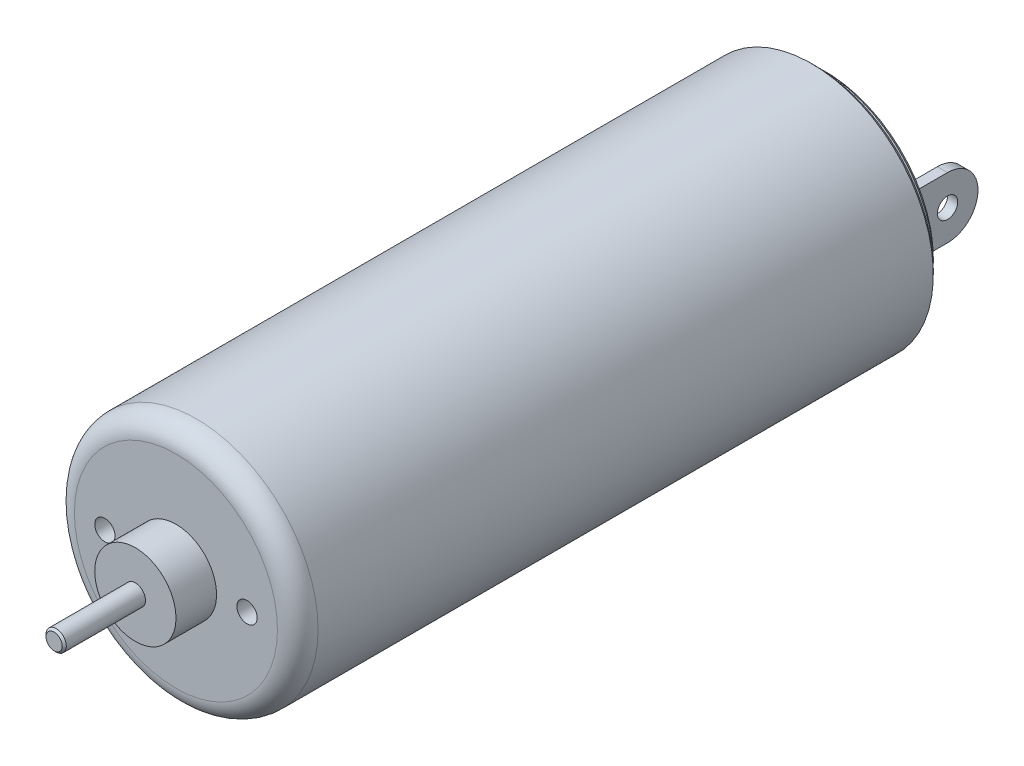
ISO-10303-21;
HEADER;
FILE_DESCRIPTION(('STEP AP214'),'2;1');
FILE_NAME('part.step','',(''),(''),'','','');
FILE_SCHEMA(('AUTOMOTIVE_DESIGN { 1 0 10303 214 1 1 1 1 }'));
ENDSEC;
DATA;
#1=APPLICATION_CONTEXT('core data for automotive mechanical design processes');
#2=APPLICATION_PROTOCOL_DEFINITION('international standard','automotive_design',2000,#1);
#3=PRODUCT_CONTEXT('',#1,'mechanical');
#4=PRODUCT('Part','Part','',(#3));
#5=PRODUCT_RELATED_PRODUCT_CATEGORY('part','',(#4));
#6=PRODUCT_DEFINITION_FORMATION('','',#4);
#7=PRODUCT_DEFINITION_CONTEXT('part definition',#1,'design');
#8=PRODUCT_DEFINITION('design','',#6,#7);
#9=PRODUCT_DEFINITION_SHAPE('','',#8);
#10=(LENGTH_UNIT() NAMED_UNIT(*) SI_UNIT(.MILLI.,.METRE.));
#11=(NAMED_UNIT(*) PLANE_ANGLE_UNIT() SI_UNIT($,.RADIAN.));
#12=(NAMED_UNIT(*) SI_UNIT($,.STERADIAN.) SOLID_ANGLE_UNIT());
#13=UNCERTAINTY_MEASURE_WITH_UNIT(LENGTH_MEASURE(1.E-05),#10,'distance_accuracy_value','');
#14=(GEOMETRIC_REPRESENTATION_CONTEXT(3) GLOBAL_UNCERTAINTY_ASSIGNED_CONTEXT((#13)) GLOBAL_UNIT_ASSIGNED_CONTEXT((#10,
#11,#12)) REPRESENTATION_CONTEXT('',''));
#15=CARTESIAN_POINT('',(0.,0.,0.));
#16=DIRECTION('',(0.,0.,1.));
#17=DIRECTION('',(1.,0.,0.));
#18=AXIS2_PLACEMENT_3D('',#15,#16,#17);
#19=CARTESIAN_POINT('',(-3.5,1.5,-23.));
#20=DIRECTION('',(-1.,0.,0.));
#21=DIRECTION('',(0.,-1.,0.));
#22=AXIS2_PLACEMENT_3D('',#19,#20,#21);
#23=PLANE('',#22);
#24=DIRECTION('',(0.,0.,1.));
#25=VECTOR('',#24,1.);
#26=CARTESIAN_POINT('',(-3.5,1.5,-23.));
#27=LINE('',#26,#25);
#28=CARTESIAN_POINT('',(-3.5,1.5,-21.5));
#29=VERTEX_POINT('',#28);
#30=CARTESIAN_POINT('',(-3.5,1.5,-19.));
#31=VERTEX_POINT('',#30);
#32=EDGE_CURVE('E137',#29,#31,#27,.T.);
#33=ORIENTED_EDGE('',*,*,#32,.F.);
#34=CARTESIAN_POINT('',(-3.5,0.,-21.5));
#35=DIRECTION('',(-1.,0.,0.));
#36=DIRECTION('',(0.,-1.,0.));
#37=AXIS2_PLACEMENT_3D('',#34,#35,#36);
#38=CIRCLE('',#37,1.5);
#39=CARTESIAN_POINT('',(-3.5,0.,-23.));
#40=VERTEX_POINT('',#39);
#41=EDGE_CURVE('E245',#29,#40,#38,.T.);
#42=ORIENTED_EDGE('',*,*,#41,.T.);
#43=CARTESIAN_POINT('',(-3.5,0.,-21.5));
#44=DIRECTION('',(-1.,0.,0.));
#45=DIRECTION('',(0.,-1.,0.));
#46=AXIS2_PLACEMENT_3D('',#43,#44,#45);
#47=CIRCLE('',#46,1.5);
#48=CARTESIAN_POINT('',(-3.5,-1.5,-21.5));
#49=VERTEX_POINT('',#48);
#50=EDGE_CURVE('E112',#40,#49,#47,.T.);
#51=ORIENTED_EDGE('',*,*,#50,.T.);
#52=DIRECTION('',(0.,0.,1.));
#53=VECTOR('',#52,1.);
#54=CARTESIAN_POINT('',(-3.5,-1.5,-23.));
#55=LINE('',#54,#53);
#56=CARTESIAN_POINT('',(-3.5,-1.5,-19.));
#57=VERTEX_POINT('',#56);
#58=EDGE_CURVE('E106',#49,#57,#55,.T.);
#59=ORIENTED_EDGE('',*,*,#58,.T.);
#60=DIRECTION('',(0.,-1.,0.));
#61=VECTOR('',#60,1.);
#62=CARTESIAN_POINT('',(-3.5,1.5,-19.));
#63=LINE('',#62,#61);
#64=EDGE_CURVE('E110',#31,#57,#63,.T.);
#65=ORIENTED_EDGE('',*,*,#64,.F.);
#66=EDGE_LOOP('',(#33,#42,#51,#59,#65));
#67=FACE_BOUND('',#66,.T.);
#68=CARTESIAN_POINT('',(-3.5,0.,-21.5));
#69=DIRECTION('',(1.,0.,0.));
#70=DIRECTION('',(0.,1.,0.));
#71=AXIS2_PLACEMENT_3D('',#68,#69,#70);
#72=CIRCLE('',#71,0.499999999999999);
#73=CARTESIAN_POINT('',(-3.5,0.499999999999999,-21.5));
#74=VERTEX_POINT('',#73);
#75=EDGE_CURVE('E241',#74,#74,#72,.T.);
#76=ORIENTED_EDGE('',*,*,#75,.T.);
#77=EDGE_LOOP('',(#76));
#78=FACE_BOUND('',#77,.T.);
#79=ADVANCED_FACE('F31',(#67,#78),#23,.T.);
#80=CARTESIAN_POINT('',(-3.,1.5,-23.));
#81=DIRECTION('',(1.,0.,0.));
#82=DIRECTION('',(0.,1.,0.));
#83=AXIS2_PLACEMENT_3D('',#80,#81,#82);
#84=PLANE('',#83);
#85=CARTESIAN_POINT('',(-3.,0.,-21.5));
#86=DIRECTION('',(1.,0.,0.));
#87=DIRECTION('',(0.,1.,0.));
#88=AXIS2_PLACEMENT_3D('',#85,#86,#87);
#89=CIRCLE('',#88,1.5);
#90=CARTESIAN_POINT('',(-3.,-1.5,-21.5));
#91=VERTEX_POINT('',#90);
#92=CARTESIAN_POINT('',(-3.,0.,-23.));
#93=VERTEX_POINT('',#92);
#94=EDGE_CURVE('E46',#91,#93,#89,.T.);
#95=ORIENTED_EDGE('',*,*,#94,.T.);
#96=CARTESIAN_POINT('',(-3.,0.,-21.5));
#97=DIRECTION('',(1.,0.,0.));
#98=DIRECTION('',(0.,1.,0.));
#99=AXIS2_PLACEMENT_3D('',#96,#97,#98);
#100=CIRCLE('',#99,1.5);
#101=CARTESIAN_POINT('',(-3.,1.5,-21.5));
#102=VERTEX_POINT('',#101);
#103=EDGE_CURVE('E39',#93,#102,#100,.T.);
#104=ORIENTED_EDGE('',*,*,#103,.T.);
#105=DIRECTION('',(0.,0.,1.));
#106=VECTOR('',#105,1.);
#107=CARTESIAN_POINT('',(-3.,1.5,-23.));
#108=LINE('',#107,#106);
#109=CARTESIAN_POINT('',(-3.,1.5,-19.));
#110=VERTEX_POINT('',#109);
#111=EDGE_CURVE('E135',#102,#110,#108,.T.);
#112=ORIENTED_EDGE('',*,*,#111,.T.);
#113=DIRECTION('',(0.,1.,0.));
#114=VECTOR('',#113,1.);
#115=CARTESIAN_POINT('',(-3.,1.5,-19.));
#116=LINE('',#115,#114);
#117=CARTESIAN_POINT('',(-3.,-1.5,-19.));
#118=VERTEX_POINT('',#117);
#119=EDGE_CURVE('E129',#118,#110,#116,.T.);
#120=ORIENTED_EDGE('',*,*,#119,.F.);
#121=DIRECTION('',(0.,0.,1.));
#122=VECTOR('',#121,1.);
#123=CARTESIAN_POINT('',(-3.,-1.5,-23.));
#124=LINE('',#123,#122);
#125=EDGE_CURVE('E114',#91,#118,#124,.T.);
#126=ORIENTED_EDGE('',*,*,#125,.F.);
#127=EDGE_LOOP('',(#95,#104,#112,#120,#126));
#128=FACE_BOUND('',#127,.T.);
#129=CARTESIAN_POINT('',(-3.,0.,-21.5));
#130=DIRECTION('',(1.,0.,0.));
#131=DIRECTION('',(0.,1.,0.));
#132=AXIS2_PLACEMENT_3D('',#129,#130,#131);
#133=CIRCLE('',#132,0.499999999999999);
#134=CARTESIAN_POINT('',(-3.,0.499999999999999,-21.5));
#135=VERTEX_POINT('',#134);
#136=EDGE_CURVE('E126',#135,#135,#133,.F.);
#137=ORIENTED_EDGE('',*,*,#136,.T.);
#138=EDGE_LOOP('',(#137));
#139=FACE_BOUND('',#138,.T.);
#140=ADVANCED_FACE('F249',(#128,#139),#84,.T.);
#141=CARTESIAN_POINT('',(0.,5.5,-19.));
#142=DIRECTION('',(0.,0.,-1.));
#143=DIRECTION('',(-1.,0.,0.));
#144=AXIS2_PLACEMENT_3D('',#141,#142,#143);
#145=PLANE('',#144);
#146=ORIENTED_EDGE('',*,*,#64,.T.);
#147=DIRECTION('',(1.,0.,0.));
#148=VECTOR('',#147,1.);
#149=CARTESIAN_POINT('',(-3.5,-1.5,-19.));
#150=LINE('',#149,#148);
#151=EDGE_CURVE('E115',#57,#118,#150,.T.);
#152=ORIENTED_EDGE('',*,*,#151,.T.);
#153=ORIENTED_EDGE('',*,*,#119,.T.);
#154=DIRECTION('',(-1.,0.,0.));
#155=VECTOR('',#154,1.);
#156=CARTESIAN_POINT('',(-3.5,1.5,-19.));
#157=LINE('',#156,#155);
#158=EDGE_CURVE('E125',#110,#31,#157,.T.);
#159=ORIENTED_EDGE('',*,*,#158,.T.);
#160=EDGE_LOOP('',(#146,#152,#153,#159));
#161=FACE_BOUND('',#160,.T.);
#162=CARTESIAN_POINT('',(0.,0.,-19.));
#163=DIRECTION('',(0.,0.,-1.));
#164=DIRECTION('',(-1.,0.,0.));
#165=AXIS2_PLACEMENT_3D('',#162,#163,#164);
#166=CIRCLE('',#165,5.3);
#167=CARTESIAN_POINT('',(-5.3,0.,-19.));
#168=VERTEX_POINT('',#167);
#169=EDGE_CURVE('E202',#168,#168,#166,.T.);
#170=ORIENTED_EDGE('',*,*,#169,.T.);
#171=EDGE_LOOP('',(#170));
#172=FACE_BOUND('',#171,.T.);
#173=CARTESIAN_POINT('',(0.,0.,-19.));
#174=DIRECTION('',(0.,0.,-1.));
#175=DIRECTION('',(-1.,0.,0.));
#176=AXIS2_PLACEMENT_3D('',#173,#174,#175);
#177=CIRCLE('',#176,0.7);
#178=CARTESIAN_POINT('',(-0.7,0.,-19.));
#179=VERTEX_POINT('',#178);
#180=EDGE_CURVE('E205',#179,#179,#177,.F.);
#181=ORIENTED_EDGE('',*,*,#180,.T.);
#182=EDGE_LOOP('',(#181));
#183=FACE_BOUND('',#182,.T.);
#184=DIRECTION('',(-1.,0.,0.));
#185=VECTOR('',#184,1.);
#186=CARTESIAN_POINT('',(3.5,-1.5,-19.));
#187=LINE('',#186,#185);
#188=CARTESIAN_POINT('',(3.5,-1.5,-19.));
#189=VERTEX_POINT('',#188);
#190=CARTESIAN_POINT('',(3.,-1.5,-19.));
#191=VERTEX_POINT('',#190);
#192=EDGE_CURVE('E149',#189,#191,#187,.T.);
#193=ORIENTED_EDGE('',*,*,#192,.F.);
#194=DIRECTION('',(0.,-1.,0.));
#195=VECTOR('',#194,1.);
#196=CARTESIAN_POINT('',(3.5,1.5,-19.));
#197=LINE('',#196,#195);
#198=CARTESIAN_POINT('',(3.5,1.5,-19.));
#199=VERTEX_POINT('',#198);
#200=EDGE_CURVE('E146',#199,#189,#197,.T.);
#201=ORIENTED_EDGE('',*,*,#200,.F.);
#202=DIRECTION('',(1.,0.,0.));
#203=VECTOR('',#202,1.);
#204=CARTESIAN_POINT('',(3.5,1.5,-19.));
#205=LINE('',#204,#203);
#206=CARTESIAN_POINT('',(3.,1.5,-19.));
#207=VERTEX_POINT('',#206);
#208=EDGE_CURVE('E155',#207,#199,#205,.T.);
#209=ORIENTED_EDGE('',*,*,#208,.F.);
#210=DIRECTION('',(0.,1.,0.));
#211=VECTOR('',#210,1.);
#212=CARTESIAN_POINT('',(3.,1.5,-19.));
#213=LINE('',#212,#211);
#214=EDGE_CURVE('E152',#191,#207,#213,.T.);
#215=ORIENTED_EDGE('',*,*,#214,.F.);
#216=EDGE_LOOP('',(#193,#201,#209,#215));
#217=FACE_BOUND('',#216,.T.);
#218=ADVANCED_FACE('F120',(#161,#172,#183,#217),#145,.T.);
#219=CARTESIAN_POINT('',(0.,2.,13.));
#220=DIRECTION('',(0.,0.,1.));
#221=DIRECTION('',(1.,0.,0.));
#222=AXIS2_PLACEMENT_3D('',#219,#220,#221);
#223=PLANE('',#222);
#224=CARTESIAN_POINT('',(3.5,0.,13.));
#225=DIRECTION('',(0.,0.,1.));
#226=DIRECTION('',(1.,0.,0.));
#227=AXIS2_PLACEMENT_3D('',#224,#225,#226);
#228=CIRCLE('',#227,0.500000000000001);
#229=CARTESIAN_POINT('',(4.,0.,13.));
#230=VERTEX_POINT('',#229);
#231=EDGE_CURVE('E166',#230,#230,#228,.T.);
#232=ORIENTED_EDGE('',*,*,#231,.F.);
#233=EDGE_LOOP('',(#232));
#234=FACE_BOUND('',#233,.T.);
#235=CARTESIAN_POINT('',(-3.5,0.,13.));
#236=DIRECTION('',(0.,0.,1.));
#237=DIRECTION('',(1.,0.,0.));
#238=AXIS2_PLACEMENT_3D('',#235,#236,#237);
#239=CIRCLE('',#238,0.5);
#240=CARTESIAN_POINT('',(-3.,0.,13.));
#241=VERTEX_POINT('',#240);
#242=EDGE_CURVE('E172',#241,#241,#239,.T.);
#243=ORIENTED_EDGE('',*,*,#242,.F.);
#244=EDGE_LOOP('',(#243));
#245=FACE_BOUND('',#244,.T.);
#246=CARTESIAN_POINT('',(0.,0.,13.));
#247=DIRECTION('',(0.,0.,1.));
#248=DIRECTION('',(1.,0.,0.));
#249=AXIS2_PLACEMENT_3D('',#246,#247,#248);
#250=CIRCLE('',#249,4.99999999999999);
#251=CARTESIAN_POINT('',(4.99999999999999,0.,13.));
#252=VERTEX_POINT('',#251);
#253=EDGE_CURVE('E196',#252,#252,#250,.T.);
#254=ORIENTED_EDGE('',*,*,#253,.T.);
#255=EDGE_LOOP('',(#254));
#256=FACE_BOUND('',#255,.T.);
#257=CARTESIAN_POINT('',(0.,0.,13.));
#258=DIRECTION('',(0.,0.,-1.));
#259=DIRECTION('',(-1.,0.,0.));
#260=AXIS2_PLACEMENT_3D('',#257,#258,#259);
#261=CIRCLE('',#260,2.);
#262=CARTESIAN_POINT('',(-2.,0.,13.));
#263=VERTEX_POINT('',#262);
#264=EDGE_CURVE('E181',#263,#263,#261,.T.);
#265=ORIENTED_EDGE('',*,*,#264,.T.);
#266=EDGE_LOOP('',(#265));
#267=FACE_BOUND('',#266,.T.);
#268=ADVANCED_FACE('F33',(#234,#245,#256,#267),#223,.T.);
#269=CARTESIAN_POINT('',(0.,0.,-26.4443229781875));
#270=DIRECTION('',(0.,0.,-1.));
#271=DIRECTION('',(-1.,0.,0.));
#272=AXIS2_PLACEMENT_3D('',#269,#270,#271);
#273=CYLINDRICAL_SURFACE('',#272,5.99999999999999);
#274=CARTESIAN_POINT('',(0.,0.,-18.3));
#275=DIRECTION('',(0.,0.,-1.));
#276=DIRECTION('',(-1.,0.,0.));
#277=AXIS2_PLACEMENT_3D('',#274,#275,#276);
#278=CIRCLE('',#277,5.99999999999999);
#279=CARTESIAN_POINT('',(-5.99999999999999,0.,-18.3));
#280=VERTEX_POINT('',#279);
#281=EDGE_CURVE('E214',#280,#280,#278,.F.);
#282=ORIENTED_EDGE('',*,*,#281,.T.);
#283=EDGE_LOOP('',(#282));
#284=FACE_BOUND('',#283,.T.);
#285=CARTESIAN_POINT('',(0.,0.,12.));
#286=DIRECTION('',(0.,0.,1.));
#287=DIRECTION('',(1.,0.,0.));
#288=AXIS2_PLACEMENT_3D('',#285,#286,#287);
#289=CIRCLE('',#288,5.99999999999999);
#290=CARTESIAN_POINT('',(5.99999999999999,0.,12.));
#291=VERTEX_POINT('',#290);
#292=EDGE_CURVE('E193',#291,#291,#289,.F.);
#293=ORIENTED_EDGE('',*,*,#292,.T.);
#294=EDGE_LOOP('',(#293));
#295=FACE_BOUND('',#294,.T.);
#296=ADVANCED_FACE('F380',(#284,#295),#273,.T.);
#297=CARTESIAN_POINT('',(0.,5.99999999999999,-18.5));
#298=DIRECTION('',(0.,0.,-1.));
#299=DIRECTION('',(-1.,0.,0.));
#300=AXIS2_PLACEMENT_3D('',#297,#298,#299);
#301=PLANE('',#300);
#302=CARTESIAN_POINT('',(0.,0.,-18.5));
#303=DIRECTION('',(0.,0.,-1.));
#304=DIRECTION('',(-1.,0.,0.));
#305=AXIS2_PLACEMENT_3D('',#302,#303,#304);
#306=CIRCLE('',#305,5.8);
#307=CARTESIAN_POINT('',(-5.8,0.,-18.5));
#308=VERTEX_POINT('',#307);
#309=EDGE_CURVE('E211',#308,#308,#306,.T.);
#310=ORIENTED_EDGE('',*,*,#309,.T.);
#311=EDGE_LOOP('',(#310));
#312=FACE_BOUND('',#311,.T.);
#313=CARTESIAN_POINT('',(0.,0.,-18.5));
#314=DIRECTION('',(0.,0.,-1.));
#315=DIRECTION('',(-1.,0.,0.));
#316=AXIS2_PLACEMENT_3D('',#313,#314,#315);
#317=CIRCLE('',#316,5.5);
#318=CARTESIAN_POINT('',(-5.5,0.,-18.5));
#319=VERTEX_POINT('',#318);
#320=EDGE_CURVE('E190',#319,#319,#317,.T.);
#321=ORIENTED_EDGE('',*,*,#320,.F.);
#322=EDGE_LOOP('',(#321));
#323=FACE_BOUND('',#322,.T.);
#324=ADVANCED_FACE('F377',(#312,#323),#301,.T.);
#325=CARTESIAN_POINT('',(0.,0.,-26.4443229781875));
#326=DIRECTION('',(0.,0.,-1.));
#327=DIRECTION('',(-1.,0.,0.));
#328=AXIS2_PLACEMENT_3D('',#325,#326,#327);
#329=CYLINDRICAL_SURFACE('',#328,5.5);
#330=CARTESIAN_POINT('',(0.,0.,-18.8));
#331=DIRECTION('',(0.,0.,-1.));
#332=DIRECTION('',(-1.,0.,0.));
#333=AXIS2_PLACEMENT_3D('',#330,#331,#332);
#334=CIRCLE('',#333,5.5);
#335=CARTESIAN_POINT('',(-5.5,0.,-18.8));
#336=VERTEX_POINT('',#335);
#337=EDGE_CURVE('E208',#336,#336,#334,.F.);
#338=ORIENTED_EDGE('',*,*,#337,.T.);
#339=EDGE_LOOP('',(#338));
#340=FACE_BOUND('',#339,.T.);
#341=ORIENTED_EDGE('',*,*,#320,.T.);
#342=EDGE_LOOP('',(#341));
#343=FACE_BOUND('',#342,.T.);
#344=ADVANCED_FACE('F371',(#340,#343),#329,.T.);
#345=CARTESIAN_POINT('',(0.,0.,19.));
#346=DIRECTION('',(0.,0.,1.));
#347=DIRECTION('',(1.,0.,0.));
#348=AXIS2_PLACEMENT_3D('',#345,#346,#347);
#349=PLANE('',#348);
#350=CARTESIAN_POINT('',(0.,0.,19.));
#351=DIRECTION('',(0.,0.,1.));
#352=DIRECTION('',(1.,0.,0.));
#353=AXIS2_PLACEMENT_3D('',#350,#351,#352);
#354=CIRCLE('',#353,0.400000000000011);
#355=CARTESIAN_POINT('',(0.400000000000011,0.,19.));
#356=VERTEX_POINT('',#355);
#357=EDGE_CURVE('E220',#356,#356,#354,.T.);
#358=ORIENTED_EDGE('',*,*,#357,.T.);
#359=EDGE_LOOP('',(#358));
#360=FACE_BOUND('',#359,.T.);
#361=ADVANCED_FACE('F367',(#360),#349,.T.);
#362=CARTESIAN_POINT('',(0.,0.,-26.4443229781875));
#363=DIRECTION('',(0.,0.,-1.));
#364=DIRECTION('',(-1.,0.,0.));
#365=AXIS2_PLACEMENT_3D('',#362,#363,#364);
#366=CYLINDRICAL_SURFACE('',#365,0.500000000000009);
#367=CARTESIAN_POINT('',(0.,0.,18.9));
#368=DIRECTION('',(0.,0.,1.));
#369=DIRECTION('',(1.,0.,0.));
#370=AXIS2_PLACEMENT_3D('',#367,#368,#369);
#371=CIRCLE('',#370,0.500000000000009);
#372=CARTESIAN_POINT('',(0.500000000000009,0.,18.9));
#373=VERTEX_POINT('',#372);
#374=EDGE_CURVE('E217',#373,#373,#371,.F.);
#375=ORIENTED_EDGE('',*,*,#374,.T.);
#376=EDGE_LOOP('',(#375));
#377=FACE_BOUND('',#376,.T.);
#378=CARTESIAN_POINT('',(0.,0.,15.));
#379=DIRECTION('',(0.,0.,-1.));
#380=DIRECTION('',(-1.,0.,0.));
#381=AXIS2_PLACEMENT_3D('',#378,#379,#380);
#382=CIRCLE('',#381,0.500000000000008);
#383=CARTESIAN_POINT('',(-0.500000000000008,0.,15.));
#384=VERTEX_POINT('',#383);
#385=EDGE_CURVE('E187',#384,#384,#382,.T.);
#386=ORIENTED_EDGE('',*,*,#385,.F.);
#387=EDGE_LOOP('',(#386));
#388=FACE_BOUND('',#387,.T.);
#389=ADVANCED_FACE('F363',(#377,#388),#366,.T.);
#390=CARTESIAN_POINT('',(0.,0.500000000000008,15.));
#391=DIRECTION('',(0.,0.,1.));
#392=DIRECTION('',(1.,0.,0.));
#393=AXIS2_PLACEMENT_3D('',#390,#391,#392);
#394=PLANE('',#393);
#395=ORIENTED_EDGE('',*,*,#385,.T.);
#396=EDGE_LOOP('',(#395));
#397=FACE_BOUND('',#396,.T.);
#398=CARTESIAN_POINT('',(0.,0.,15.));
#399=DIRECTION('',(0.,0.,-1.));
#400=DIRECTION('',(-1.,0.,0.));
#401=AXIS2_PLACEMENT_3D('',#398,#399,#400);
#402=CIRCLE('',#401,2.);
#403=CARTESIAN_POINT('',(-2.,0.,15.));
#404=VERTEX_POINT('',#403);
#405=EDGE_CURVE('E184',#404,#404,#402,.T.);
#406=ORIENTED_EDGE('',*,*,#405,.F.);
#407=EDGE_LOOP('',(#406));
#408=FACE_BOUND('',#407,.T.);
#409=ADVANCED_FACE('F359',(#397,#408),#394,.T.);
#410=CARTESIAN_POINT('',(0.,0.,-26.4443229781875));
#411=DIRECTION('',(0.,0.,-1.));
#412=DIRECTION('',(-1.,0.,0.));
#413=AXIS2_PLACEMENT_3D('',#410,#411,#412);
#414=CYLINDRICAL_SURFACE('',#413,2.);
#415=ORIENTED_EDGE('',*,*,#405,.T.);
#416=EDGE_LOOP('',(#415));
#417=FACE_BOUND('',#416,.T.);
#418=ORIENTED_EDGE('',*,*,#264,.F.);
#419=EDGE_LOOP('',(#418));
#420=FACE_BOUND('',#419,.T.);
#421=ADVANCED_FACE('F355',(#417,#420),#414,.T.);
#422=CARTESIAN_POINT('',(0.,0.,12.));
#423=DIRECTION('',(0.,0.,1.));
#424=DIRECTION('',(1.,0.,0.));
#425=AXIS2_PLACEMENT_3D('',#422,#423,#424);
#426=TOROIDAL_SURFACE('',#425,4.99999999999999,1.);
#427=ORIENTED_EDGE('',*,*,#253,.F.);
#428=EDGE_LOOP('',(#427));
#429=FACE_BOUND('',#428,.T.);
#430=ORIENTED_EDGE('',*,*,#292,.F.);
#431=EDGE_LOOP('',(#430));
#432=FACE_BOUND('',#431,.T.);
#433=ADVANCED_FACE('F351',(#429,#432),#426,.T.);
#434=CARTESIAN_POINT('',(0.,0.,-18.));
#435=DIRECTION('',(0.,0.,-1.));
#436=DIRECTION('',(-1.,0.,0.));
#437=AXIS2_PLACEMENT_3D('',#434,#435,#436);
#438=CYLINDRICAL_SURFACE('',#437,0.5);
#439=CARTESIAN_POINT('',(0.,0.,-18.8));
#440=DIRECTION('',(0.,0.,-1.));
#441=DIRECTION('',(-1.,0.,0.));
#442=AXIS2_PLACEMENT_3D('',#439,#440,#441);
#443=CIRCLE('',#442,0.5);
#444=CARTESIAN_POINT('',(-0.5,0.,-18.8));
#445=VERTEX_POINT('',#444);
#446=EDGE_CURVE('E199',#445,#445,#443,.T.);
#447=ORIENTED_EDGE('',*,*,#446,.T.);
#448=EDGE_LOOP('',(#447));
#449=FACE_BOUND('',#448,.T.);
#450=CARTESIAN_POINT('',(0.,0.,-18.));
#451=DIRECTION('',(0.,0.,-1.));
#452=DIRECTION('',(-1.,0.,0.));
#453=AXIS2_PLACEMENT_3D('',#450,#451,#452);
#454=CIRCLE('',#453,0.5);
#455=CARTESIAN_POINT('',(-0.5,0.,-18.));
#456=VERTEX_POINT('',#455);
#457=EDGE_CURVE('E178',#456,#456,#454,.T.);
#458=ORIENTED_EDGE('',*,*,#457,.F.);
#459=EDGE_LOOP('',(#458));
#460=FACE_BOUND('',#459,.T.);
#461=ADVANCED_FACE('F347',(#449,#460),#438,.F.);
#462=CARTESIAN_POINT('',(0.,0.,-18.));
#463=DIRECTION('',(0.,0.,-1.));
#464=DIRECTION('',(-1.,0.,0.));
#465=AXIS2_PLACEMENT_3D('',#462,#463,#464);
#466=PLANE('',#465);
#467=ORIENTED_EDGE('',*,*,#457,.T.);
#468=EDGE_LOOP('',(#467));
#469=FACE_BOUND('',#468,.T.);
#470=ADVANCED_FACE('F343',(#469),#466,.T.);
#471=CARTESIAN_POINT('',(0.,0.,-18.8));
#472=DIRECTION('',(0.,0.,-1.));
#473=DIRECTION('',(-1.,0.,0.));
#474=AXIS2_PLACEMENT_3D('',#471,#472,#473);
#475=CONICAL_SURFACE('',#474,0.5,0.785398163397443);
#476=ORIENTED_EDGE('',*,*,#180,.F.);
#477=EDGE_LOOP('',(#476));
#478=FACE_BOUND('',#477,.T.);
#479=ORIENTED_EDGE('',*,*,#446,.F.);
#480=EDGE_LOOP('',(#479));
#481=FACE_BOUND('',#480,.T.);
#482=ADVANCED_FACE('F339',(#478,#481),#475,.F.);
#483=CARTESIAN_POINT('',(0.,0.,-19.));
#484=DIRECTION('',(0.,0.,1.));
#485=DIRECTION('',(1.,0.,0.));
#486=AXIS2_PLACEMENT_3D('',#483,#484,#485);
#487=CONICAL_SURFACE('',#486,5.3,0.785398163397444);
#488=ORIENTED_EDGE('',*,*,#337,.F.);
#489=EDGE_LOOP('',(#488));
#490=FACE_BOUND('',#489,.T.);
#491=ORIENTED_EDGE('',*,*,#169,.F.);
#492=EDGE_LOOP('',(#491));
#493=FACE_BOUND('',#492,.T.);
#494=ADVANCED_FACE('F335',(#490,#493),#487,.T.);
#495=CARTESIAN_POINT('',(0.,0.,-18.5));
#496=DIRECTION('',(0.,0.,1.));
#497=DIRECTION('',(1.,0.,0.));
#498=AXIS2_PLACEMENT_3D('',#495,#496,#497);
#499=CONICAL_SURFACE('',#498,5.8,0.785398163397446);
#500=ORIENTED_EDGE('',*,*,#281,.F.);
#501=EDGE_LOOP('',(#500));
#502=FACE_BOUND('',#501,.T.);
#503=ORIENTED_EDGE('',*,*,#309,.F.);
#504=EDGE_LOOP('',(#503));
#505=FACE_BOUND('',#504,.T.);
#506=ADVANCED_FACE('F331',(#502,#505),#499,.T.);
#507=CARTESIAN_POINT('',(0.,0.,18.9));
#508=DIRECTION('',(0.,0.,-1.));
#509=DIRECTION('',(-1.,0.,0.));
#510=AXIS2_PLACEMENT_3D('',#507,#508,#509);
#511=CONICAL_SURFACE('',#510,0.500000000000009,0.785398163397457);
#512=ORIENTED_EDGE('',*,*,#357,.F.);
#513=EDGE_LOOP('',(#512));
#514=FACE_BOUND('',#513,.T.);
#515=ORIENTED_EDGE('',*,*,#374,.F.);
#516=EDGE_LOOP('',(#515));
#517=FACE_BOUND('',#516,.T.);
#518=ADVANCED_FACE('F327',(#514,#517),#511,.T.);
#519=CARTESIAN_POINT('',(-3.5,0.,11.));
#520=DIRECTION('',(0.,0.,1.));
#521=DIRECTION('',(1.,0.,0.));
#522=AXIS2_PLACEMENT_3D('',#519,#520,#521);
#523=CYLINDRICAL_SURFACE('',#522,0.5);
#524=CARTESIAN_POINT('',(-3.5,0.,11.));
#525=DIRECTION('',(0.,0.,1.));
#526=DIRECTION('',(1.,0.,0.));
#527=AXIS2_PLACEMENT_3D('',#524,#525,#526);
#528=CIRCLE('',#527,0.5);
#529=CARTESIAN_POINT('',(-3.,0.,11.));
#530=VERTEX_POINT('',#529);
#531=EDGE_CURVE('E175',#530,#530,#528,.T.);
#532=ORIENTED_EDGE('',*,*,#531,.F.);
#533=EDGE_LOOP('',(#532));
#534=FACE_BOUND('',#533,.T.);
#535=ORIENTED_EDGE('',*,*,#242,.T.);
#536=EDGE_LOOP('',(#535));
#537=FACE_BOUND('',#536,.T.);
#538=ADVANCED_FACE('F323',(#534,#537),#523,.F.);
#539=CARTESIAN_POINT('',(-3.5,0.,11.));
#540=DIRECTION('',(0.,0.,1.));
#541=DIRECTION('',(1.,0.,0.));
#542=AXIS2_PLACEMENT_3D('',#539,#540,#541);
#543=PLANE('',#542);
#544=ORIENTED_EDGE('',*,*,#531,.T.);
#545=EDGE_LOOP('',(#544));
#546=FACE_BOUND('',#545,.T.);
#547=ADVANCED_FACE('F319',(#546),#543,.T.);
#548=CARTESIAN_POINT('',(3.5,0.,11.));
#549=DIRECTION('',(0.,0.,1.));
#550=DIRECTION('',(1.,0.,0.));
#551=AXIS2_PLACEMENT_3D('',#548,#549,#550);
#552=CYLINDRICAL_SURFACE('',#551,0.500000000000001);
#553=CARTESIAN_POINT('',(3.5,0.,11.));
#554=DIRECTION('',(0.,0.,1.));
#555=DIRECTION('',(1.,0.,0.));
#556=AXIS2_PLACEMENT_3D('',#553,#554,#555);
#557=CIRCLE('',#556,0.500000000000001);
#558=CARTESIAN_POINT('',(4.,0.,11.));
#559=VERTEX_POINT('',#558);
#560=EDGE_CURVE('E169',#559,#559,#557,.T.);
#561=ORIENTED_EDGE('',*,*,#560,.F.);
#562=EDGE_LOOP('',(#561));
#563=FACE_BOUND('',#562,.T.);
#564=ORIENTED_EDGE('',*,*,#231,.T.);
#565=EDGE_LOOP('',(#564));
#566=FACE_BOUND('',#565,.T.);
#567=ADVANCED_FACE('F315',(#563,#566),#552,.F.);
#568=CARTESIAN_POINT('',(3.5,0.,11.));
#569=DIRECTION('',(0.,0.,1.));
#570=DIRECTION('',(1.,0.,0.));
#571=AXIS2_PLACEMENT_3D('',#568,#569,#570);
#572=PLANE('',#571);
#573=ORIENTED_EDGE('',*,*,#560,.T.);
#574=EDGE_LOOP('',(#573));
#575=FACE_BOUND('',#574,.T.);
#576=ADVANCED_FACE('F311',(#575),#572,.T.);
#577=CARTESIAN_POINT('',(3.5,1.5,-23.));
#578=DIRECTION('',(-1.,0.,0.));
#579=DIRECTION('',(0.,-1.,0.));
#580=AXIS2_PLACEMENT_3D('',#577,#578,#579);
#581=PLANE('',#580);
#582=CARTESIAN_POINT('',(3.5,0.,-21.5));
#583=DIRECTION('',(1.,0.,0.));
#584=DIRECTION('',(0.,1.,0.));
#585=AXIS2_PLACEMENT_3D('',#582,#583,#584);
#586=CIRCLE('',#585,0.499999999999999);
#587=CARTESIAN_POINT('',(3.5,0.499999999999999,-21.5));
#588=VERTEX_POINT('',#587);
#589=EDGE_CURVE('E142',#588,#588,#586,.T.);
#590=ORIENTED_EDGE('',*,*,#589,.F.);
#591=EDGE_LOOP('',(#590));
#592=FACE_BOUND('',#591,.T.);
#593=CARTESIAN_POINT('',(3.5,0.,-21.5));
#594=DIRECTION('',(-1.,0.,0.));
#595=DIRECTION('',(0.,-1.,0.));
#596=AXIS2_PLACEMENT_3D('',#593,#594,#595);
#597=CIRCLE('',#596,1.5);
#598=CARTESIAN_POINT('',(3.5,-1.5,-21.5));
#599=VERTEX_POINT('',#598);
#600=CARTESIAN_POINT('',(3.5,0.,-23.));
#601=VERTEX_POINT('',#600);
#602=EDGE_CURVE('E223',#599,#601,#597,.F.);
#603=ORIENTED_EDGE('',*,*,#602,.T.);
#604=CARTESIAN_POINT('',(3.5,0.,-21.5));
#605=DIRECTION('',(-1.,0.,0.));
#606=DIRECTION('',(0.,-1.,0.));
#607=AXIS2_PLACEMENT_3D('',#604,#605,#606);
#608=CIRCLE('',#607,1.5);
#609=CARTESIAN_POINT('',(3.5,1.5,-21.5));
#610=VERTEX_POINT('',#609);
#611=EDGE_CURVE('E227',#601,#610,#608,.F.);
#612=ORIENTED_EDGE('',*,*,#611,.T.);
#613=DIRECTION('',(0.,0.,1.));
#614=VECTOR('',#613,1.);
#615=CARTESIAN_POINT('',(3.5,1.5,-23.));
#616=LINE('',#615,#614);
#617=EDGE_CURVE('E158',#610,#199,#616,.T.);
#618=ORIENTED_EDGE('',*,*,#617,.T.);
#619=ORIENTED_EDGE('',*,*,#200,.T.);
#620=DIRECTION('',(0.,0.,1.));
#621=VECTOR('',#620,1.);
#622=CARTESIAN_POINT('',(3.5,-1.5,-23.));
#623=LINE('',#622,#621);
#624=EDGE_CURVE('E164',#599,#189,#623,.T.);
#625=ORIENTED_EDGE('',*,*,#624,.F.);
#626=EDGE_LOOP('',(#603,#612,#618,#619,#625));
#627=FACE_BOUND('',#626,.T.);
#628=ADVANCED_FACE('F307',(#592,#627),#581,.F.);
#629=CARTESIAN_POINT('',(3.5,-1.5,-23.));
#630=DIRECTION('',(0.,1.,0.));
#631=DIRECTION('',(0.,0.,1.));
#632=AXIS2_PLACEMENT_3D('',#629,#630,#631);
#633=PLANE('',#632);
#634=DIRECTION('',(0.,0.,1.));
#635=VECTOR('',#634,1.);
#636=CARTESIAN_POINT('',(3.,-1.5,-23.));
#637=LINE('',#636,#635);
#638=CARTESIAN_POINT('',(3.,-1.5,-21.5));
#639=VERTEX_POINT('',#638);
#640=EDGE_CURVE('E162',#639,#191,#637,.T.);
#641=ORIENTED_EDGE('',*,*,#640,.F.);
#642=DIRECTION('',(-1.,0.,0.));
#643=VECTOR('',#642,1.);
#644=CARTESIAN_POINT('',(3.5,-1.5,-21.5));
#645=LINE('',#644,#643);
#646=EDGE_CURVE('E236',#639,#599,#645,.F.);
#647=ORIENTED_EDGE('',*,*,#646,.T.);
#648=ORIENTED_EDGE('',*,*,#624,.T.);
#649=ORIENTED_EDGE('',*,*,#192,.T.);
#650=EDGE_LOOP('',(#641,#647,#648,#649));
#651=FACE_BOUND('',#650,.T.);
#652=ADVANCED_FACE('F303',(#651),#633,.F.);
#653=CARTESIAN_POINT('',(3.,1.5,-23.));
#654=DIRECTION('',(1.,0.,0.));
#655=DIRECTION('',(0.,1.,0.));
#656=AXIS2_PLACEMENT_3D('',#653,#654,#655);
#657=PLANE('',#656);
#658=CARTESIAN_POINT('',(3.,0.,-21.5));
#659=DIRECTION('',(1.,0.,0.));
#660=DIRECTION('',(0.,1.,0.));
#661=AXIS2_PLACEMENT_3D('',#658,#659,#660);
#662=CIRCLE('',#661,0.499999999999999);
#663=CARTESIAN_POINT('',(3.,0.499999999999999,-21.5));
#664=VERTEX_POINT('',#663);
#665=EDGE_CURVE('E145',#664,#664,#662,.T.);
#666=ORIENTED_EDGE('',*,*,#665,.T.);
#667=EDGE_LOOP('',(#666));
#668=FACE_BOUND('',#667,.T.);
#669=DIRECTION('',(0.,0.,1.));
#670=VECTOR('',#669,1.);
#671=CARTESIAN_POINT('',(3.,1.5,-23.));
#672=LINE('',#671,#670);
#673=CARTESIAN_POINT('',(3.,1.5,-21.5));
#674=VERTEX_POINT('',#673);
#675=EDGE_CURVE('E160',#674,#207,#672,.T.);
#676=ORIENTED_EDGE('',*,*,#675,.F.);
#677=CARTESIAN_POINT('',(3.,0.,-21.5));
#678=DIRECTION('',(1.,0.,0.));
#679=DIRECTION('',(0.,1.,0.));
#680=AXIS2_PLACEMENT_3D('',#677,#678,#679);
#681=CIRCLE('',#680,1.5);
#682=CARTESIAN_POINT('',(3.,0.,-23.));
#683=VERTEX_POINT('',#682);
#684=EDGE_CURVE('E234',#674,#683,#681,.F.);
#685=ORIENTED_EDGE('',*,*,#684,.T.);
#686=CARTESIAN_POINT('',(3.,0.,-21.5));
#687=DIRECTION('',(1.,0.,0.));
#688=DIRECTION('',(0.,1.,0.));
#689=AXIS2_PLACEMENT_3D('',#686,#687,#688);
#690=CIRCLE('',#689,1.5);
#691=EDGE_CURVE('E232',#683,#639,#690,.F.);
#692=ORIENTED_EDGE('',*,*,#691,.T.);
#693=ORIENTED_EDGE('',*,*,#640,.T.);
#694=ORIENTED_EDGE('',*,*,#214,.T.);
#695=EDGE_LOOP('',(#676,#685,#692,#693,#694));
#696=FACE_BOUND('',#695,.T.);
#697=ADVANCED_FACE('F299',(#668,#696),#657,.F.);
#698=CARTESIAN_POINT('',(3.5,1.5,-23.));
#699=DIRECTION('',(0.,-1.,0.));
#700=DIRECTION('',(0.,0.,-1.));
#701=AXIS2_PLACEMENT_3D('',#698,#699,#700);
#702=PLANE('',#701);
#703=ORIENTED_EDGE('',*,*,#617,.F.);
#704=DIRECTION('',(1.,0.,0.));
#705=VECTOR('',#704,1.);
#706=CARTESIAN_POINT('',(3.,1.5,-21.5));
#707=LINE('',#706,#705);
#708=EDGE_CURVE('E229',#610,#674,#707,.F.);
#709=ORIENTED_EDGE('',*,*,#708,.T.);
#710=ORIENTED_EDGE('',*,*,#675,.T.);
#711=ORIENTED_EDGE('',*,*,#208,.T.);
#712=EDGE_LOOP('',(#703,#709,#710,#711));
#713=FACE_BOUND('',#712,.T.);
#714=ADVANCED_FACE('F295',(#713),#702,.F.);
#715=CARTESIAN_POINT('',(-0.5,0.,-21.5));
#716=DIRECTION('',(1.,0.,0.));
#717=DIRECTION('',(0.,1.,0.));
#718=AXIS2_PLACEMENT_3D('',#715,#716,#717);
#719=CYLINDRICAL_SURFACE('',#718,0.499999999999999);
#720=ORIENTED_EDGE('',*,*,#589,.T.);
#721=EDGE_LOOP('',(#720));
#722=FACE_BOUND('',#721,.T.);
#723=ORIENTED_EDGE('',*,*,#665,.F.);
#724=EDGE_LOOP('',(#723));
#725=FACE_BOUND('',#724,.T.);
#726=ADVANCED_FACE('F291',(#722,#725),#719,.F.);
#727=CARTESIAN_POINT('',(3.5,0.,-21.5));
#728=DIRECTION('',(1.,0.,0.));
#729=DIRECTION('',(0.,0.,-1.));
#730=AXIS2_PLACEMENT_3D('',#727,#728,#729);
#731=CYLINDRICAL_SURFACE('',#730,1.5);
#732=ORIENTED_EDGE('',*,*,#646,.F.);
#733=ORIENTED_EDGE('',*,*,#691,.F.);
#734=DIRECTION('',(-1.,0.,0.));
#735=VECTOR('',#734,1.);
#736=CARTESIAN_POINT('',(3.,0.,-23.));
#737=LINE('',#736,#735);
#738=EDGE_CURVE('E139',#601,#683,#737,.T.);
#739=ORIENTED_EDGE('',*,*,#738,.F.);
#740=ORIENTED_EDGE('',*,*,#602,.F.);
#741=EDGE_LOOP('',(#732,#733,#739,#740));
#742=FACE_BOUND('',#741,.T.);
#743=ADVANCED_FACE('F287',(#742),#731,.T.);
#744=CARTESIAN_POINT('',(3.5,0.,-21.5));
#745=DIRECTION('',(-1.,0.,0.));
#746=DIRECTION('',(0.,0.,1.));
#747=AXIS2_PLACEMENT_3D('',#744,#745,#746);
#748=CYLINDRICAL_SURFACE('',#747,1.5);
#749=ORIENTED_EDGE('',*,*,#684,.F.);
#750=ORIENTED_EDGE('',*,*,#708,.F.);
#751=ORIENTED_EDGE('',*,*,#611,.F.);
#752=ORIENTED_EDGE('',*,*,#738,.T.);
#753=EDGE_LOOP('',(#749,#750,#751,#752));
#754=FACE_BOUND('',#753,.T.);
#755=ADVANCED_FACE('F284',(#754),#748,.T.);
#756=CARTESIAN_POINT('',(-3.5,1.5,-23.));
#757=DIRECTION('',(0.,1.,0.));
#758=DIRECTION('',(0.,0.,1.));
#759=AXIS2_PLACEMENT_3D('',#756,#757,#758);
#760=PLANE('',#759);
#761=ORIENTED_EDGE('',*,*,#111,.F.);
#762=DIRECTION('',(-1.,0.,0.));
#763=VECTOR('',#762,1.);
#764=CARTESIAN_POINT('',(-3.5,1.5,-21.5));
#765=LINE('',#764,#763);
#766=EDGE_CURVE('E238',#102,#29,#765,.T.);
#767=ORIENTED_EDGE('',*,*,#766,.T.);
#768=ORIENTED_EDGE('',*,*,#32,.T.);
#769=ORIENTED_EDGE('',*,*,#158,.F.);
#770=EDGE_LOOP('',(#761,#767,#768,#769));
#771=FACE_BOUND('',#770,.T.);
#772=ADVANCED_FACE('F255',(#771),#760,.T.);
#773=CARTESIAN_POINT('',(-3.5,-1.5,-23.));
#774=DIRECTION('',(0.,-1.,0.));
#775=DIRECTION('',(0.,0.,-1.));
#776=AXIS2_PLACEMENT_3D('',#773,#774,#775);
#777=PLANE('',#776);
#778=ORIENTED_EDGE('',*,*,#58,.F.);
#779=DIRECTION('',(1.,0.,0.));
#780=VECTOR('',#779,1.);
#781=CARTESIAN_POINT('',(-3.5,-1.5,-21.5));
#782=LINE('',#781,#780);
#783=EDGE_CURVE('E11',#49,#91,#782,.T.);
#784=ORIENTED_EDGE('',*,*,#783,.T.);
#785=ORIENTED_EDGE('',*,*,#125,.T.);
#786=ORIENTED_EDGE('',*,*,#151,.F.);
#787=EDGE_LOOP('',(#778,#784,#785,#786));
#788=FACE_BOUND('',#787,.T.);
#789=ADVANCED_FACE('F128',(#788),#777,.T.);
#790=CARTESIAN_POINT('',(0.5,0.,-21.5));
#791=DIRECTION('',(-1.,0.,0.));
#792=DIRECTION('',(0.,-1.,0.));
#793=AXIS2_PLACEMENT_3D('',#790,#791,#792);
#794=CYLINDRICAL_SURFACE('',#793,0.499999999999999);
#795=ORIENTED_EDGE('',*,*,#136,.F.);
#796=EDGE_LOOP('',(#795));
#797=FACE_BOUND('',#796,.T.);
#798=ORIENTED_EDGE('',*,*,#75,.F.);
#799=EDGE_LOOP('',(#798));
#800=FACE_BOUND('',#799,.T.);
#801=ADVANCED_FACE('F265',(#797,#800),#794,.F.);
#802=CARTESIAN_POINT('',(-3.5,0.,-21.5));
#803=DIRECTION('',(1.,0.,0.));
#804=DIRECTION('',(0.,0.,-1.));
#805=AXIS2_PLACEMENT_3D('',#802,#803,#804);
#806=CYLINDRICAL_SURFACE('',#805,1.5);
#807=DIRECTION('',(1.,0.,0.));
#808=VECTOR('',#807,1.);
#809=CARTESIAN_POINT('',(-3.5,0.,-23.));
#810=LINE('',#809,#808);
#811=EDGE_CURVE('E257',#93,#40,#810,.F.);
#812=ORIENTED_EDGE('',*,*,#811,.F.);
#813=ORIENTED_EDGE('',*,*,#94,.F.);
#814=ORIENTED_EDGE('',*,*,#783,.F.);
#815=ORIENTED_EDGE('',*,*,#50,.F.);
#816=EDGE_LOOP('',(#812,#813,#814,#815));
#817=FACE_BOUND('',#816,.T.);
#818=ADVANCED_FACE('F259',(#817),#806,.T.);
#819=CARTESIAN_POINT('',(-3.5,0.,-21.5));
#820=DIRECTION('',(-1.,0.,0.));
#821=DIRECTION('',(0.,0.,1.));
#822=AXIS2_PLACEMENT_3D('',#819,#820,#821);
#823=CYLINDRICAL_SURFACE('',#822,1.5);
#824=ORIENTED_EDGE('',*,*,#103,.F.);
#825=ORIENTED_EDGE('',*,*,#811,.T.);
#826=ORIENTED_EDGE('',*,*,#41,.F.);
#827=ORIENTED_EDGE('',*,*,#766,.F.);
#828=EDGE_LOOP('',(#824,#825,#826,#827));
#829=FACE_BOUND('',#828,.T.);
#830=ADVANCED_FACE('F256',(#829),#823,.T.);
#831=CLOSED_SHELL('',(#79,#140,#218,#268,#296,#324,#344,#361,#389,#409,#421,#433,#461,#470,#482,
#494,#506,#518,#538,#547,#567,#576,#628,#652,#697,#714,#726,#743,#755,#772,#789,#801,#818,#830));
#832=MANIFOLD_SOLID_BREP('B2',#831);
#833=ADVANCED_BREP_SHAPE_REPRESENTATION('',(#18,#832),#14);
#834=SHAPE_DEFINITION_REPRESENTATION(#9,#833);
ENDSEC;
END-ISO-10303-21;
